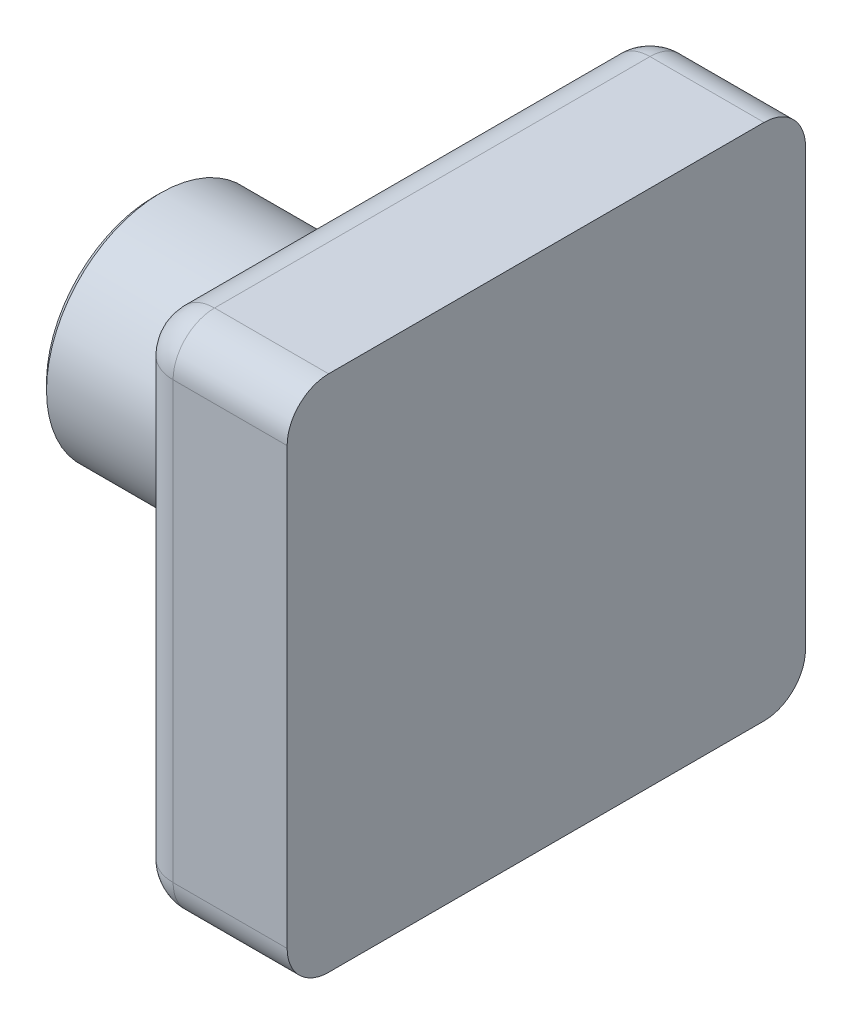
ISO-10303-21;
HEADER;
FILE_DESCRIPTION(('STEP AP214'),'2;1');
FILE_NAME('part.step','',(''),(''),'','','');
FILE_SCHEMA(('AUTOMOTIVE_DESIGN { 1 0 10303 214 1 1 1 1 }'));
ENDSEC;
DATA;
#1=APPLICATION_CONTEXT('core data for automotive mechanical design processes');
#2=APPLICATION_PROTOCOL_DEFINITION('international standard','automotive_design',2000,#1);
#3=PRODUCT_CONTEXT('',#1,'mechanical');
#4=PRODUCT('Part','Part','',(#3));
#5=PRODUCT_RELATED_PRODUCT_CATEGORY('part','',(#4));
#6=PRODUCT_DEFINITION_FORMATION('','',#4);
#7=PRODUCT_DEFINITION_CONTEXT('part definition',#1,'design');
#8=PRODUCT_DEFINITION('design','',#6,#7);
#9=PRODUCT_DEFINITION_SHAPE('','',#8);
#10=(LENGTH_UNIT() NAMED_UNIT(*) SI_UNIT(.MILLI.,.METRE.));
#11=(NAMED_UNIT(*) PLANE_ANGLE_UNIT() SI_UNIT($,.RADIAN.));
#12=(NAMED_UNIT(*) SI_UNIT($,.STERADIAN.) SOLID_ANGLE_UNIT());
#13=UNCERTAINTY_MEASURE_WITH_UNIT(LENGTH_MEASURE(1.E-05),#10,'distance_accuracy_value','');
#14=(GEOMETRIC_REPRESENTATION_CONTEXT(3) GLOBAL_UNCERTAINTY_ASSIGNED_CONTEXT((#13)) GLOBAL_UNIT_ASSIGNED_CONTEXT((#10,
#11,#12)) REPRESENTATION_CONTEXT('',''));
#15=CARTESIAN_POINT('',(0.,0.,0.));
#16=DIRECTION('',(0.,0.,1.));
#17=DIRECTION('',(1.,0.,0.));
#18=AXIS2_PLACEMENT_3D('',#15,#16,#17);
#19=CARTESIAN_POINT('',(-31.75,0.,0.));
#20=DIRECTION('',(1.,0.,0.));
#21=DIRECTION('',(0.,1.,0.));
#22=AXIS2_PLACEMENT_3D('',#19,#20,#21);
#23=PLANE('',#22);
#24=CARTESIAN_POINT('',(-31.75,0.,0.));
#25=DIRECTION('',(1.,0.,0.));
#26=DIRECTION('',(0.,1.,0.));
#27=AXIS2_PLACEMENT_3D('',#24,#25,#26);
#28=CIRCLE('',#27,10.3505);
#29=CARTESIAN_POINT('',(-31.75,10.3505,0.));
#30=VERTEX_POINT('',#29);
#31=EDGE_CURVE('E452',#30,#30,#28,.F.);
#32=ORIENTED_EDGE('',*,*,#31,.T.);
#33=EDGE_LOOP('',(#32));
#34=FACE_BOUND('',#33,.T.);
#35=CARTESIAN_POINT('',(-31.75,0.,0.));
#36=DIRECTION('',(-1.,0.,0.));
#37=DIRECTION('',(0.,0.,1.));
#38=AXIS2_PLACEMENT_3D('',#35,#36,#37);
#39=CIRCLE('',#38,8.98025612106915);
#40=CARTESIAN_POINT('',(-31.75,6.35,6.35));
#41=VERTEX_POINT('',#40);
#42=CARTESIAN_POINT('',(-31.75,6.35,-6.34999999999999));
#43=VERTEX_POINT('',#42);
#44=EDGE_CURVE('E185',#41,#43,#39,.T.);
#45=ORIENTED_EDGE('',*,*,#44,.F.);
#46=CARTESIAN_POINT('',(-31.75,-6.35,6.35000000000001));
#47=VERTEX_POINT('',#46);
#48=EDGE_CURVE('E189',#47,#41,#39,.T.);
#49=ORIENTED_EDGE('',*,*,#48,.F.);
#50=CARTESIAN_POINT('',(-31.75,-6.35,-6.35000000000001));
#51=VERTEX_POINT('',#50);
#52=EDGE_CURVE('E182',#51,#47,#39,.T.);
#53=ORIENTED_EDGE('',*,*,#52,.F.);
#54=EDGE_CURVE('E178',#43,#51,#39,.T.);
#55=ORIENTED_EDGE('',*,*,#54,.F.);
#56=EDGE_LOOP('',(#45,#49,#53,#55));
#57=FACE_BOUND('',#56,.T.);
#58=ADVANCED_FACE('F42',(#34,#57),#23,.F.);
#59=CARTESIAN_POINT('',(-31.75,0.,0.));
#60=DIRECTION('',(-1.,0.,0.));
#61=DIRECTION('',(0.,-1.,0.));
#62=AXIS2_PLACEMENT_3D('',#59,#60,#61);
#63=CYLINDRICAL_SURFACE('',#62,10.9855);
#64=CARTESIAN_POINT('',(-12.89,0.,0.));
#65=DIRECTION('',(-1.,0.,0.));
#66=DIRECTION('',(0.,-1.,0.));
#67=AXIS2_PLACEMENT_3D('',#64,#65,#66);
#68=CIRCLE('',#67,10.9855);
#69=CARTESIAN_POINT('',(-12.89,-10.9855,0.));
#70=VERTEX_POINT('',#69);
#71=EDGE_CURVE('E458',#70,#70,#68,.T.);
#72=ORIENTED_EDGE('',*,*,#71,.T.);
#73=EDGE_LOOP('',(#72));
#74=FACE_BOUND('',#73,.T.);
#75=CARTESIAN_POINT('',(-31.115,0.,0.));
#76=DIRECTION('',(1.,0.,0.));
#77=DIRECTION('',(0.,1.,0.));
#78=AXIS2_PLACEMENT_3D('',#75,#76,#77);
#79=CIRCLE('',#78,10.9855);
#80=CARTESIAN_POINT('',(-31.115,10.9855,0.));
#81=VERTEX_POINT('',#80);
#82=EDGE_CURVE('E454',#81,#81,#79,.T.);
#83=ORIENTED_EDGE('',*,*,#82,.T.);
#84=EDGE_LOOP('',(#83));
#85=FACE_BOUND('',#84,.T.);
#86=ADVANCED_FACE('F221',(#74,#85),#63,.T.);
#87=CARTESIAN_POINT('',(-31.75,0.,0.));
#88=DIRECTION('',(-1.,0.,0.));
#89=DIRECTION('',(0.,0.,1.));
#90=AXIS2_PLACEMENT_3D('',#87,#88,#89);
#91=CONICAL_SURFACE('',#90,8.98025612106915,1.0471975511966);
#92=ORIENTED_EDGE('',*,*,#54,.T.);
#93=ORIENTED_EDGE('',*,*,#52,.T.);
#94=ORIENTED_EDGE('',*,*,#48,.T.);
#95=ORIENTED_EDGE('',*,*,#44,.T.);
#96=EDGE_LOOP('',(#92,#93,#94,#95));
#97=FACE_BOUND('',#96,.T.);
#98=CARTESIAN_POINT('',(-31.4975796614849,-6.35,-5.715));
#99=CARTESIAN_POINT('',(-31.4930347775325,-6.24416666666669,-5.82083333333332));
#100=CARTESIAN_POINT('',(-31.490762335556,-6.13833333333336,-5.92666666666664));
#101=CARTESIAN_POINT('',(-31.4907623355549,-5.92666666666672,-6.13833333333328));
#102=CARTESIAN_POINT('',(-31.4930347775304,-5.8208333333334,-6.24416666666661));
#103=CARTESIAN_POINT('',(-31.4975796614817,-5.71500000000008,-6.34999999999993));
#104=B_SPLINE_CURVE_WITH_KNOTS('',3,(#98,#99,#100,#101,#102,#103),.UNSPECIFIED.,.F.,.F.,(4,2,4),
(0.,0.449064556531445,0.898129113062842),.UNSPECIFIED.);
#105=CARTESIAN_POINT('',(-31.4975796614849,-6.35,-5.71500000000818));
#106=VERTEX_POINT('',#105);
#107=CARTESIAN_POINT('',(-31.4975796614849,-5.71500000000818,-6.35));
#108=VERTEX_POINT('',#107);
#109=EDGE_CURVE('E271',#106,#108,#104,.T.);
#110=ORIENTED_EDGE('',*,*,#109,.T.);
#111=CARTESIAN_POINT('',(-34.5170187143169,-12.2216829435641,-6.35));
#112=CARTESIAN_POINT('',(-34.3615732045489,-11.9182206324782,-6.35));
#113=CARTESIAN_POINT('',(-34.2070611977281,-11.6142750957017,-6.35));
#114=CARTESIAN_POINT('',(-33.9004047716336,-11.0051661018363,-6.35));
#115=CARTESIAN_POINT('',(-33.7482605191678,-10.700002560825,-6.35));
#116=CARTESIAN_POINT('',(-33.4464743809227,-10.0874615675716,-6.35));
#117=CARTESIAN_POINT('',(-33.2968399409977,-9.78008043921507,-6.35));
#118=CARTESIAN_POINT('',(-33.0011956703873,-9.16358609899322,-6.35));
#119=CARTESIAN_POINT('',(-32.8551857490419,-8.8544729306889,-6.35));
#120=CARTESIAN_POINT('',(-32.5599848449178,-8.21743331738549,-6.35));
#121=CARTESIAN_POINT('',(-32.4110456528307,-7.88938979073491,-6.35));
#122=CARTESIAN_POINT('',(-32.1197000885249,-7.23037405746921,-6.35));
#123=CARTESIAN_POINT('',(-31.9772941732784,-6.899401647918,-6.35));
#124=CARTESIAN_POINT('',(-31.7012019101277,-6.23418432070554,-6.35));
#125=CARTESIAN_POINT('',(-31.5675074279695,-5.89994280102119,-6.35));
#126=CARTESIAN_POINT('',(-31.3115264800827,-5.22714688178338,-6.35));
#127=CARTESIAN_POINT('',(-31.1892380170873,-4.88859324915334,-6.35));
#128=CARTESIAN_POINT('',(-30.9611061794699,-4.20993043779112,-6.35));
#129=CARTESIAN_POINT('',(-30.8551015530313,-3.86987621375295,-6.35));
#130=CARTESIAN_POINT('',(-30.6628644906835,-3.18413618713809,-6.35));
#131=CARTESIAN_POINT('',(-30.5766318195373,-2.8384504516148,-6.35));
#132=CARTESIAN_POINT('',(-30.4311430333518,-2.14800522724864,-6.35));
#133=CARTESIAN_POINT('',(-30.3714127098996,-1.80334925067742,-6.35));
#134=CARTESIAN_POINT('',(-30.3042871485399,-1.28351315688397,-6.35));
#135=CARTESIAN_POINT('',(-30.2856566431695,-1.10975186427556,-6.35));
#136=CARTESIAN_POINT('',(-30.2563555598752,-0.761566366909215,-6.35));
#137=CARTESIAN_POINT('',(-30.2456841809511,-0.587142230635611,-6.35));
#138=CARTESIAN_POINT('',(-30.2314197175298,-0.205994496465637,-6.35));
#139=CARTESIAN_POINT('',(-30.2294811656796,0.000793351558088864,-6.35));
#140=CARTESIAN_POINT('',(-30.2372733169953,0.414151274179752,-6.35));
#141=CARTESIAN_POINT('',(-30.2470044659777,0.620721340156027,-6.35));
#142=CARTESIAN_POINT('',(-30.2777433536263,1.03306047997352,-6.35));
#143=CARTESIAN_POINT('',(-30.298753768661,1.23882935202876,-6.35));
#144=CARTESIAN_POINT('',(-30.3512617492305,1.64901372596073,-6.35));
#145=CARTESIAN_POINT('',(-30.3827595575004,1.85342919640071,-6.35));
#146=CARTESIAN_POINT('',(-30.4561496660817,2.26592140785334,-6.35));
#147=CARTESIAN_POINT('',(-30.4982936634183,2.473952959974,-6.35));
#148=CARTESIAN_POINT('',(-30.5912838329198,2.88804833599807,-6.35));
#149=CARTESIAN_POINT('',(-30.642130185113,3.09411211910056,-6.35));
#150=CARTESIAN_POINT('',(-30.7513127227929,3.50429697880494,-6.35));
#151=CARTESIAN_POINT('',(-30.8096511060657,3.70841746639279,-6.35));
#152=CARTESIAN_POINT('',(-30.9326808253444,4.11470771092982,-6.35));
#153=CARTESIAN_POINT('',(-30.9973717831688,4.31687758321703,-6.35));
#154=CARTESIAN_POINT('',(-31.1961967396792,4.91094204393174,-6.35));
#155=CARTESIAN_POINT('',(-31.3378374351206,5.30032383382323,-6.35));
#156=CARTESIAN_POINT('',(-31.635662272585,6.07351976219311,-6.35));
#157=CARTESIAN_POINT('',(-31.7918507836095,6.4573321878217,-6.35));
#158=CARTESIAN_POINT('',(-32.1148992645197,7.22086654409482,-6.35));
#159=CARTESIAN_POINT('',(-32.2817697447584,7.60058400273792,-6.35));
#160=CARTESIAN_POINT('',(-32.623232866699,8.35645832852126,-6.35));
#161=CARTESIAN_POINT('',(-32.7978246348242,8.73261559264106,-6.35));
#162=CARTESIAN_POINT('',(-33.1534440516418,9.48349912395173,-6.35));
#163=CARTESIAN_POINT('',(-33.3344923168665,9.85821559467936,-6.35));
#164=CARTESIAN_POINT('',(-33.7010603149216,10.605459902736,-6.35));
#165=CARTESIAN_POINT('',(-33.8865801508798,10.9779876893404,-6.35));
#166=CARTESIAN_POINT('',(-34.2609884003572,11.7210791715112,-6.35));
#167=CARTESIAN_POINT('',(-34.4498748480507,12.0916438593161,-6.35));
#168=CARTESIAN_POINT('',(-34.8303948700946,12.8313540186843,-6.35));
#169=CARTESIAN_POINT('',(-35.0220284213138,13.2004995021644,-6.35));
#170=CARTESIAN_POINT('',(-35.5484391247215,14.2071897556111,-6.35));
#171=CARTESIAN_POINT('',(-35.8854076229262,14.8435881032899,-6.35));
#172=CARTESIAN_POINT('',(-36.5640154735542,16.1140140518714,-6.35));
#173=CARTESIAN_POINT('',(-36.9056555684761,16.748041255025,-6.35));
#174=CARTESIAN_POINT('',(-37.5898982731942,18.0097984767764,-6.35));
#175=CARTESIAN_POINT('',(-37.932477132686,18.6375413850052,-6.35));
#176=CARTESIAN_POINT('',(-38.448197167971,19.5780641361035,-6.35));
#177=CARTESIAN_POINT('',(-38.6203966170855,19.8913611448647,-6.35));
#178=CARTESIAN_POINT('',(-38.9653493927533,20.5176494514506,-6.35));
#179=CARTESIAN_POINT('',(-39.138102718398,20.8306407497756,-6.35));
#180=CARTESIAN_POINT('',(-39.3110964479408,21.1434991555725,-6.35));
#181=B_SPLINE_CURVE_WITH_KNOTS('',3,(#111,#112,#113,#114,#115,#116,#117,#118,#119,#120,#121,
#122,#123,#124,#125,#126,#127,#128,#129,#130,#131,#132,#133,#134,#135,#136,#137,#138,#139,#140,
#141,#142,#143,#144,#145,#146,#147,#148,#149,#150,#151,#152,#153,#154,#155,#156,#157,#158,#159,
#160,#161,#162,#163,#164,#165,#166,#167,#168,#169,#170,#171,#172,#173,#174,#175,#176,#177,#178,
#179,#180),.UNSPECIFIED.,.F.,.F.,(4,2,2,2,2,2,2,2,2,2,2,2,2,2,2,2,2,2,2,2,2,2,2,2,2,2,2,2,2,2,2,
2,2,2,4),(0.,1.02288050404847,2.04583274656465,3.07141705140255,4.09697567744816,
5.17773511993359,6.25857004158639,7.3383808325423,8.41800218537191,9.48612698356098,
10.5542390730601,11.6023818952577,12.1264966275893,12.6505586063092,13.270611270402,
13.8906876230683,14.5109111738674,15.1311490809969,15.7677069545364,16.4042779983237,
17.0410362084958,17.6777565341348,18.9203192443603,20.1632563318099,21.4074357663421,
22.6514747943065,23.8999228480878,25.1483997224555,26.3961700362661,27.6439298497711,
29.8042128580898,31.9648433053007,34.1102472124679,35.1827527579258,36.2552565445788),.UNSPECIFIED.);
#182=CARTESIAN_POINT('',(-31.4975796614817,5.71499999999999,-6.35));
#183=VERTEX_POINT('',#182);
#184=EDGE_CURVE('E239',#183,#108,#181,.F.);
#185=ORIENTED_EDGE('',*,*,#184,.F.);
#186=CARTESIAN_POINT('',(-31.4975796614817,5.715,-6.35));
#187=CARTESIAN_POINT('',(-31.4930347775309,5.82083333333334,-6.24416666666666));
#188=CARTESIAN_POINT('',(-31.4907623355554,5.92666666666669,-6.13833333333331));
#189=CARTESIAN_POINT('',(-31.4907623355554,6.13833333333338,-5.92666666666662));
#190=CARTESIAN_POINT('',(-31.4930347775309,6.24416666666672,-5.82083333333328));
#191=CARTESIAN_POINT('',(-31.4975796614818,6.35000000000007,-5.71499999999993));
#192=B_SPLINE_CURVE_WITH_KNOTS('',3,(#186,#187,#188,#189,#190,#191),.UNSPECIFIED.,.F.,.F.,(4,2,
4),(0.,0.449064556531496,0.898129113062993),.UNSPECIFIED.);
#193=CARTESIAN_POINT('',(-31.4975796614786,6.35,-5.71499999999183));
#194=VERTEX_POINT('',#193);
#195=EDGE_CURVE('E263',#183,#194,#192,.T.);
#196=ORIENTED_EDGE('',*,*,#195,.T.);
#197=CARTESIAN_POINT('',(-34.5170187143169,6.35,-12.2216829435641));
#198=CARTESIAN_POINT('',(-34.3615732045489,6.35,-11.9182206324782));
#199=CARTESIAN_POINT('',(-34.2070611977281,6.35,-11.6142750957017));
#200=CARTESIAN_POINT('',(-33.9004047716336,6.35,-11.0051661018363));
#201=CARTESIAN_POINT('',(-33.7482605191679,6.35,-10.700002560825));
#202=CARTESIAN_POINT('',(-33.4464743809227,6.35,-10.0874615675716));
#203=CARTESIAN_POINT('',(-33.2968399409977,6.35,-9.78008043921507));
#204=CARTESIAN_POINT('',(-33.0011956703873,6.35,-9.16358609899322));
#205=CARTESIAN_POINT('',(-32.8551857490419,6.35,-8.85447293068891));
#206=CARTESIAN_POINT('',(-32.5599848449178,6.35,-8.2174333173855));
#207=CARTESIAN_POINT('',(-32.4110456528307,6.35,-7.88938979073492));
#208=CARTESIAN_POINT('',(-32.1197000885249,6.35,-7.23037405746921));
#209=CARTESIAN_POINT('',(-31.9772941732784,6.35,-6.899401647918));
#210=CARTESIAN_POINT('',(-31.7012019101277,6.35,-6.23418432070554));
#211=CARTESIAN_POINT('',(-31.5675074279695,6.35,-5.89994280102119));
#212=CARTESIAN_POINT('',(-31.3115264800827,6.35,-5.22714688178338));
#213=CARTESIAN_POINT('',(-31.1892380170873,6.35,-4.88859324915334));
#214=CARTESIAN_POINT('',(-30.9611061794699,6.35,-4.20993043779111));
#215=CARTESIAN_POINT('',(-30.8551015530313,6.35,-3.86987621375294));
#216=CARTESIAN_POINT('',(-30.6628644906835,6.35,-3.18413618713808));
#217=CARTESIAN_POINT('',(-30.5766318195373,6.35,-2.8384504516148));
#218=CARTESIAN_POINT('',(-30.4311430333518,6.35,-2.14800522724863));
#219=CARTESIAN_POINT('',(-30.3714127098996,6.35,-1.80334925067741));
#220=CARTESIAN_POINT('',(-30.3042871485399,6.35,-1.28351315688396));
#221=CARTESIAN_POINT('',(-30.2856566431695,6.35,-1.10975186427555));
#222=CARTESIAN_POINT('',(-30.2563555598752,6.35,-0.76156636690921));
#223=CARTESIAN_POINT('',(-30.2456841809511,6.35,-0.587142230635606));
#224=CARTESIAN_POINT('',(-30.2314197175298,6.35,-0.205994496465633));
#225=CARTESIAN_POINT('',(-30.2294811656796,6.35,0.000793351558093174));
#226=CARTESIAN_POINT('',(-30.2372733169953,6.35,0.414151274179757));
#227=CARTESIAN_POINT('',(-30.2470044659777,6.35,0.620721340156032));
#228=CARTESIAN_POINT('',(-30.2777433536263,6.35,1.03306047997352));
#229=CARTESIAN_POINT('',(-30.298753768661,6.35,1.23882935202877));
#230=CARTESIAN_POINT('',(-30.3512617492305,6.35,1.64901372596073));
#231=CARTESIAN_POINT('',(-30.3827595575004,6.35,1.85342919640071));
#232=CARTESIAN_POINT('',(-30.4561496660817,6.35,2.26592140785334));
#233=CARTESIAN_POINT('',(-30.4982936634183,6.35,2.473952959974));
#234=CARTESIAN_POINT('',(-30.5912838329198,6.35,2.88804833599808));
#235=CARTESIAN_POINT('',(-30.642130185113,6.35,3.09411211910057));
#236=CARTESIAN_POINT('',(-30.751312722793,6.35,3.50429697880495));
#237=CARTESIAN_POINT('',(-30.8096511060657,6.35,3.70841746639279));
#238=CARTESIAN_POINT('',(-30.9326808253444,6.35,4.11470771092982));
#239=CARTESIAN_POINT('',(-30.9973717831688,6.35,4.31687758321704));
#240=CARTESIAN_POINT('',(-31.1961967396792,6.35,4.91094204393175));
#241=CARTESIAN_POINT('',(-31.3378374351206,6.35,5.30032383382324));
#242=CARTESIAN_POINT('',(-31.635662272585,6.35,6.07351976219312));
#243=CARTESIAN_POINT('',(-31.7918507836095,6.35,6.45733218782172));
#244=CARTESIAN_POINT('',(-32.1148992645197,6.35,7.22086654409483));
#245=CARTESIAN_POINT('',(-32.2817697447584,6.35,7.60058400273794));
#246=CARTESIAN_POINT('',(-32.623232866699,6.35,8.35645832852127));
#247=CARTESIAN_POINT('',(-32.7978246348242,6.35,8.73261559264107));
#248=CARTESIAN_POINT('',(-33.1534440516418,6.35,9.48349912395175));
#249=CARTESIAN_POINT('',(-33.3344923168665,6.35,9.85821559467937));
#250=CARTESIAN_POINT('',(-33.7010603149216,6.35,10.605459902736));
#251=CARTESIAN_POINT('',(-33.8865801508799,6.35,10.9779876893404));
#252=CARTESIAN_POINT('',(-34.2609884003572,6.35,11.7210791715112));
#253=CARTESIAN_POINT('',(-34.4498748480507,6.35,12.0916438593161));
#254=CARTESIAN_POINT('',(-34.8303948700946,6.35,12.8313540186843));
#255=CARTESIAN_POINT('',(-35.0220284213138,6.35,13.2004995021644));
#256=CARTESIAN_POINT('',(-35.5484391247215,6.35,14.2071897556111));
#257=CARTESIAN_POINT('',(-35.8854076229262,6.35,14.8435881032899));
#258=CARTESIAN_POINT('',(-36.5640154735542,6.35,16.1140140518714));
#259=CARTESIAN_POINT('',(-36.9056555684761,6.35,16.748041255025));
#260=CARTESIAN_POINT('',(-37.5898982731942,6.35,18.0097984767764));
#261=CARTESIAN_POINT('',(-37.932477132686,6.35,18.6375413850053));
#262=CARTESIAN_POINT('',(-38.448197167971,6.35,19.5780641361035));
#263=CARTESIAN_POINT('',(-38.6203966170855,6.35,19.8913611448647));
#264=CARTESIAN_POINT('',(-38.9653493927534,6.35,20.5176494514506));
#265=CARTESIAN_POINT('',(-39.138102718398,6.35,20.8306407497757));
#266=CARTESIAN_POINT('',(-39.3110964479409,6.35,21.1434991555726));
#267=B_SPLINE_CURVE_WITH_KNOTS('',3,(#197,#198,#199,#200,#201,#202,#203,#204,#205,#206,#207,
#208,#209,#210,#211,#212,#213,#214,#215,#216,#217,#218,#219,#220,#221,#222,#223,#224,#225,#226,
#227,#228,#229,#230,#231,#232,#233,#234,#235,#236,#237,#238,#239,#240,#241,#242,#243,#244,#245,
#246,#247,#248,#249,#250,#251,#252,#253,#254,#255,#256,#257,#258,#259,#260,#261,#262,#263,#264,
#265,#266),.UNSPECIFIED.,.F.,.F.,(4,2,2,2,2,2,2,2,2,2,2,2,2,2,2,2,2,2,2,2,2,2,2,2,2,2,2,2,2,2,2,
2,2,2,4),(0.,1.02288050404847,2.04583274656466,3.07141705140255,4.09697567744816,
5.17773511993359,6.2585700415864,7.33838083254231,8.41800218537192,9.48612698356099,
10.5542390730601,11.6023818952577,12.1264966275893,12.6505586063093,13.270611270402,
13.8906876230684,14.5109111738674,15.1311490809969,15.7677069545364,16.4042779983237,
17.0410362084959,17.6777565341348,18.9203192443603,20.1632563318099,21.4074357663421,
22.6514747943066,23.8999228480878,25.1483997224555,26.3961700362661,27.6439298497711,
29.8042128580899,31.9648433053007,34.110247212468,35.1827527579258,36.2552565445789),.UNSPECIFIED.);
#268=CARTESIAN_POINT('',(-31.4975796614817,6.35,5.715));
#269=VERTEX_POINT('',#268);
#270=EDGE_CURVE('E206',#269,#194,#267,.F.);
#271=ORIENTED_EDGE('',*,*,#270,.F.);
#272=CARTESIAN_POINT('',(-31.4975796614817,6.35,5.715));
#273=CARTESIAN_POINT('',(-31.4930347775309,6.24416666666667,5.82083333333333));
#274=CARTESIAN_POINT('',(-31.4907623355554,6.13833333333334,5.92666666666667));
#275=CARTESIAN_POINT('',(-31.4907623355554,5.92666666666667,6.13833333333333));
#276=CARTESIAN_POINT('',(-31.4930347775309,5.82083333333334,6.24416666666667));
#277=CARTESIAN_POINT('',(-31.4975796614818,5.71500000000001,6.35));
#278=B_SPLINE_CURVE_WITH_KNOTS('',3,(#272,#273,#274,#275,#276,#277),.UNSPECIFIED.,.F.,.F.,(4,2,
4),(0.,0.449064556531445,0.89812911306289),.UNSPECIFIED.);
#279=CARTESIAN_POINT('',(-31.4975796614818,5.71500000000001,6.35));
#280=VERTEX_POINT('',#279);
#281=EDGE_CURVE('E256',#269,#280,#278,.T.);
#282=ORIENTED_EDGE('',*,*,#281,.T.);
#283=CARTESIAN_POINT('',(-34.5170187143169,-12.2216829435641,6.35));
#284=CARTESIAN_POINT('',(-34.3615732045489,-11.9182206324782,6.35));
#285=CARTESIAN_POINT('',(-34.2070611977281,-11.6142750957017,6.35));
#286=CARTESIAN_POINT('',(-33.9004047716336,-11.0051661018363,6.35));
#287=CARTESIAN_POINT('',(-33.7482605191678,-10.700002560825,6.35));
#288=CARTESIAN_POINT('',(-33.4464743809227,-10.0874615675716,6.35));
#289=CARTESIAN_POINT('',(-33.2968399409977,-9.78008043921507,6.35));
#290=CARTESIAN_POINT('',(-33.0011956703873,-9.16358609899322,6.35));
#291=CARTESIAN_POINT('',(-32.8551857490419,-8.85447293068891,6.35));
#292=CARTESIAN_POINT('',(-32.5599848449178,-8.2174333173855,6.35));
#293=CARTESIAN_POINT('',(-32.4110456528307,-7.88938979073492,6.35));
#294=CARTESIAN_POINT('',(-32.1197000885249,-7.23037405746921,6.35));
#295=CARTESIAN_POINT('',(-31.9772941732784,-6.899401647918,6.35));
#296=CARTESIAN_POINT('',(-31.7012019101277,-6.23418432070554,6.35));
#297=CARTESIAN_POINT('',(-31.5675074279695,-5.89994280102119,6.35));
#298=CARTESIAN_POINT('',(-31.3115264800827,-5.22714688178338,6.35));
#299=CARTESIAN_POINT('',(-31.1892380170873,-4.88859324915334,6.35));
#300=CARTESIAN_POINT('',(-30.9611061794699,-4.20993043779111,6.35));
#301=CARTESIAN_POINT('',(-30.8551015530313,-3.86987621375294,6.35));
#302=CARTESIAN_POINT('',(-30.6628644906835,-3.18413618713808,6.35));
#303=CARTESIAN_POINT('',(-30.5766318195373,-2.8384504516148,6.35));
#304=CARTESIAN_POINT('',(-30.4311430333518,-2.14800522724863,6.35));
#305=CARTESIAN_POINT('',(-30.3714127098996,-1.80334925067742,6.35));
#306=CARTESIAN_POINT('',(-30.3042871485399,-1.28351315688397,6.35));
#307=CARTESIAN_POINT('',(-30.2856566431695,-1.10975186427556,6.35));
#308=CARTESIAN_POINT('',(-30.2563555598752,-0.761566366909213,6.35));
#309=CARTESIAN_POINT('',(-30.2456841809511,-0.58714223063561,6.35));
#310=CARTESIAN_POINT('',(-30.2314197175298,-0.205994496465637,6.35));
#311=CARTESIAN_POINT('',(-30.2294811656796,0.00079335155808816,6.35));
#312=CARTESIAN_POINT('',(-30.2372733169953,0.414151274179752,6.35));
#313=CARTESIAN_POINT('',(-30.2470044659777,0.620721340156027,6.35));
#314=CARTESIAN_POINT('',(-30.2777433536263,1.03306047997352,6.35));
#315=CARTESIAN_POINT('',(-30.298753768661,1.23882935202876,6.35));
#316=CARTESIAN_POINT('',(-30.3512617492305,1.64901372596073,6.35));
#317=CARTESIAN_POINT('',(-30.3827595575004,1.85342919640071,6.35));
#318=CARTESIAN_POINT('',(-30.4561496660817,2.26592140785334,6.35));
#319=CARTESIAN_POINT('',(-30.4982936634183,2.473952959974,6.35));
#320=CARTESIAN_POINT('',(-30.5912838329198,2.88804833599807,6.35));
#321=CARTESIAN_POINT('',(-30.642130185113,3.09411211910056,6.35));
#322=CARTESIAN_POINT('',(-30.7513127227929,3.50429697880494,6.35));
#323=CARTESIAN_POINT('',(-30.8096511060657,3.70841746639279,6.35));
#324=CARTESIAN_POINT('',(-30.9326808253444,4.11470771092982,6.35));
#325=CARTESIAN_POINT('',(-30.9973717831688,4.31687758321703,6.35));
#326=CARTESIAN_POINT('',(-31.1961967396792,4.91094204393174,6.35));
#327=CARTESIAN_POINT('',(-31.3378374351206,5.30032383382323,6.35));
#328=CARTESIAN_POINT('',(-31.635662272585,6.07351976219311,6.35));
#329=CARTESIAN_POINT('',(-31.7918507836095,6.45733218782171,6.35));
#330=CARTESIAN_POINT('',(-32.1148992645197,7.22086654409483,6.35));
#331=CARTESIAN_POINT('',(-32.2817697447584,7.60058400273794,6.35));
#332=CARTESIAN_POINT('',(-32.623232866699,8.35645832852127,6.35));
#333=CARTESIAN_POINT('',(-32.7978246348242,8.73261559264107,6.35));
#334=CARTESIAN_POINT('',(-33.1534440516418,9.48349912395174,6.35));
#335=CARTESIAN_POINT('',(-33.3344923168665,9.85821559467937,6.35));
#336=CARTESIAN_POINT('',(-33.7010603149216,10.605459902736,6.35));
#337=CARTESIAN_POINT('',(-33.8865801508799,10.9779876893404,6.35));
#338=CARTESIAN_POINT('',(-34.2609884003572,11.7210791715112,6.35));
#339=CARTESIAN_POINT('',(-34.4498748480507,12.0916438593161,6.35));
#340=CARTESIAN_POINT('',(-34.8303948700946,12.8313540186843,6.35));
#341=CARTESIAN_POINT('',(-35.0220284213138,13.2004995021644,6.35));
#342=CARTESIAN_POINT('',(-35.5484391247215,14.2071897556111,6.35));
#343=CARTESIAN_POINT('',(-35.8854076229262,14.8435881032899,6.35));
#344=CARTESIAN_POINT('',(-36.5640154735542,16.1140140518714,6.35));
#345=CARTESIAN_POINT('',(-36.9056555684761,16.748041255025,6.35));
#346=CARTESIAN_POINT('',(-37.5898982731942,18.0097984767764,6.35));
#347=CARTESIAN_POINT('',(-37.932477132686,18.6375413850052,6.35));
#348=CARTESIAN_POINT('',(-38.448197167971,19.5780641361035,6.35));
#349=CARTESIAN_POINT('',(-38.6203966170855,19.8913611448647,6.35));
#350=CARTESIAN_POINT('',(-38.9653493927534,20.5176494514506,6.35));
#351=CARTESIAN_POINT('',(-39.138102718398,20.8306407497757,6.35));
#352=CARTESIAN_POINT('',(-39.3110964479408,21.1434991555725,6.35));
#353=B_SPLINE_CURVE_WITH_KNOTS('',3,(#283,#284,#285,#286,#287,#288,#289,#290,#291,#292,#293,
#294,#295,#296,#297,#298,#299,#300,#301,#302,#303,#304,#305,#306,#307,#308,#309,#310,#311,#312,
#313,#314,#315,#316,#317,#318,#319,#320,#321,#322,#323,#324,#325,#326,#327,#328,#329,#330,#331,
#332,#333,#334,#335,#336,#337,#338,#339,#340,#341,#342,#343,#344,#345,#346,#347,#348,#349,#350,
#351,#352),.UNSPECIFIED.,.F.,.F.,(4,2,2,2,2,2,2,2,2,2,2,2,2,2,2,2,2,2,2,2,2,2,2,2,2,2,2,2,2,2,2,
2,2,2,4),(0.,1.02288050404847,2.04583274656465,3.07141705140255,4.09697567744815,
5.17773511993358,6.25857004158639,7.3383808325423,8.41800218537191,9.48612698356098,
10.5542390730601,11.6023818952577,12.1264966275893,12.6505586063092,13.270611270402,
13.8906876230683,14.5109111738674,15.1311490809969,15.7677069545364,16.4042779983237,
17.0410362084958,17.6777565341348,18.9203192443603,20.1632563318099,21.4074357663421,
22.6514747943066,23.8999228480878,25.1483997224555,26.3961700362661,27.6439298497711,
29.8042128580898,31.9648433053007,34.1102472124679,35.1827527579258,36.2552565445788),.UNSPECIFIED.);
#354=CARTESIAN_POINT('',(-31.4975796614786,-5.71499999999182,6.35));
#355=VERTEX_POINT('',#354);
#356=EDGE_CURVE('E196',#355,#280,#353,.T.);
#357=ORIENTED_EDGE('',*,*,#356,.F.);
#358=CARTESIAN_POINT('',(-31.4975796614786,-5.715,6.35));
#359=CARTESIAN_POINT('',(-31.4930347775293,-5.82083333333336,6.24416666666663));
#360=CARTESIAN_POINT('',(-31.4907623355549,-5.92666666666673,6.13833333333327));
#361=CARTESIAN_POINT('',(-31.490762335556,-6.13833333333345,5.92666666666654));
#362=CARTESIAN_POINT('',(-31.4930347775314,-6.24416666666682,5.82083333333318));
#363=CARTESIAN_POINT('',(-31.4975796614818,-6.35000000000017,5.71499999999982));
#364=B_SPLINE_CURVE_WITH_KNOTS('',3,(#358,#359,#360,#361,#362,#363),.UNSPECIFIED.,.F.,.F.,(4,2,
4),(0.,0.449064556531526,0.898129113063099),.UNSPECIFIED.);
#365=CARTESIAN_POINT('',(-31.4975796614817,-6.35,5.715));
#366=VERTEX_POINT('',#365);
#367=EDGE_CURVE('E248',#355,#366,#364,.T.);
#368=ORIENTED_EDGE('',*,*,#367,.T.);
#369=CARTESIAN_POINT('',(-34.5170187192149,-6.35,-12.2216829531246));
#370=CARTESIAN_POINT('',(-34.361573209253,-6.35,-11.9182206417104));
#371=CARTESIAN_POINT('',(-34.2070612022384,-6.35,-11.6142751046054));
#372=CARTESIAN_POINT('',(-33.9004047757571,-6.35,-11.0051661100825));
#373=CARTESIAN_POINT('',(-33.7482605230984,-6.35,-10.7000025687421));
#374=CARTESIAN_POINT('',(-33.4464743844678,-6.35,-10.087461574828));
#375=CARTESIAN_POINT('',(-33.2968399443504,-6.35,-9.78008044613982));
#376=CARTESIAN_POINT('',(-33.0011956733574,-6.35,-9.16358610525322));
#377=CARTESIAN_POINT('',(-32.8551857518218,-6.35,-8.85447293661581));
#378=CARTESIAN_POINT('',(-32.5599848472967,-6.35,-8.21743332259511));
#379=CARTESIAN_POINT('',(-32.4110456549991,-6.35,-7.88938979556));
#380=CARTESIAN_POINT('',(-32.1197000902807,-6.35,-7.23037406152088));
#381=CARTESIAN_POINT('',(-31.9772941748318,-6.35,-6.89940165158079));
#382=CARTESIAN_POINT('',(-31.7012019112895,-6.35,-6.23418432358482));
#383=CARTESIAN_POINT('',(-31.567507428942,-6.35,-5.89994280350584));
#384=CARTESIAN_POINT('',(-31.3115264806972,-6.35,-5.22714688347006));
#385=CARTESIAN_POINT('',(-31.1892380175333,-6.35,-4.88859325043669));
#386=CARTESIAN_POINT('',(-30.9611061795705,-6.35,-4.20993043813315));
#387=CARTESIAN_POINT('',(-30.8551015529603,-6.35,-3.86987621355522));
#388=CARTESIAN_POINT('',(-30.6628644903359,-6.35,-3.18413618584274));
#389=CARTESIAN_POINT('',(-30.5766318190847,-6.35,-2.8384504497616));
#390=CARTESIAN_POINT('',(-30.4311430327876,-6.35,-2.14800522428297));
#391=CARTESIAN_POINT('',(-30.3714127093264,-6.35,-1.80334924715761));
#392=CARTESIAN_POINT('',(-30.3042871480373,-6.35,-1.28351315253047));
#393=CARTESIAN_POINT('',(-30.2856566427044,-6.35,-1.1097518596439));
#394=CARTESIAN_POINT('',(-30.2563555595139,-6.35,-0.761566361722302));
#395=CARTESIAN_POINT('',(-30.245684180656,-6.35,-0.587142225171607));
#396=CARTESIAN_POINT('',(-30.2314197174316,-6.35,-0.205994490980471));
#397=CARTESIAN_POINT('',(-30.229481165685,-6.35,0.000793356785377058));
#398=CARTESIAN_POINT('',(-30.2372733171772,-6.35,0.414151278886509));
#399=CARTESIAN_POINT('',(-30.2470044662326,-6.35,0.620721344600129));
#400=CARTESIAN_POINT('',(-30.2777433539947,-6.35,1.03306048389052));
#401=CARTESIAN_POINT('',(-30.29875376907,-6.35,1.23882935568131));
#402=CARTESIAN_POINT('',(-30.3512617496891,-6.35,1.64901372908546));
#403=CARTESIAN_POINT('',(-30.3827595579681,-6.35,1.85342919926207));
#404=CARTESIAN_POINT('',(-30.4561496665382,-6.35,2.26592141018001));
#405=CARTESIAN_POINT('',(-30.4982936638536,-6.35,2.47395296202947));
#406=CARTESIAN_POINT('',(-30.591283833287,-6.35,2.88804833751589));
#407=CARTESIAN_POINT('',(-30.6421301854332,-6.35,3.09411212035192));
#408=CARTESIAN_POINT('',(-30.7513127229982,-6.35,3.50429697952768));
#409=CARTESIAN_POINT('',(-30.8096511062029,-6.35,3.70841746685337));
#410=CARTESIAN_POINT('',(-30.9326808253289,-6.35,4.11470771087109));
#411=CARTESIAN_POINT('',(-30.9973717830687,-6.35,4.31687758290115));
#412=CARTESIAN_POINT('',(-31.1961967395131,-6.35,4.91094204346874));
#413=CARTESIAN_POINT('',(-31.3378374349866,-6.35,5.30032383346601));
#414=CARTESIAN_POINT('',(-31.635662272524,-6.35,6.07351976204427));
#415=CARTESIAN_POINT('',(-31.7918507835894,-6.35,6.45733218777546));
#416=CARTESIAN_POINT('',(-32.1148992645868,-6.35,7.22086654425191));
#417=CARTESIAN_POINT('',(-32.2817697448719,-6.35,7.60058400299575));
#418=CARTESIAN_POINT('',(-32.6232328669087,-6.35,8.35645832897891));
#419=CARTESIAN_POINT('',(-32.7978246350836,-6.35,8.73261559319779));
#420=CARTESIAN_POINT('',(-33.1534440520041,-6.35,9.48349912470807));
#421=CARTESIAN_POINT('',(-33.3344923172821,-6.35,9.85821559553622));
#422=CARTESIAN_POINT('',(-33.701060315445,-6.35,10.6054599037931));
#423=CARTESIAN_POINT('',(-33.8865801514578,-6.35,10.9779876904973));
#424=CARTESIAN_POINT('',(-34.2609884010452,-6.35,11.7210791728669));
#425=CARTESIAN_POINT('',(-34.4498748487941,-6.35,12.0916438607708));
#426=CARTESIAN_POINT('',(-34.8303948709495,-6.35,12.8313540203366));
#427=CARTESIAN_POINT('',(-35.0220284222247,-6.35,13.2004995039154));
#428=CARTESIAN_POINT('',(-35.5484391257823,-6.35,14.207189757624));
#429=CARTESIAN_POINT('',(-35.8854076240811,-6.35,14.8435881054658));
#430=CARTESIAN_POINT('',(-36.5640154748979,-6.35,16.1140140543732));
#431=CARTESIAN_POINT('',(-36.9056555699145,-6.35,16.7480412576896));
#432=CARTESIAN_POINT('',(-37.5898982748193,-6.35,18.009798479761));
#433=CARTESIAN_POINT('',(-37.9324771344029,-6.35,18.637541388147));
#434=CARTESIAN_POINT('',(-38.4481971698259,-6.35,19.5780641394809));
#435=CARTESIAN_POINT('',(-38.6203966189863,-6.35,19.8913611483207));
#436=CARTESIAN_POINT('',(-38.965349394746,-6.35,20.5176494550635));
#437=CARTESIAN_POINT('',(-39.1381027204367,-6.35,20.8306407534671));
#438=CARTESIAN_POINT('',(-39.3110964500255,-6.35,21.1434991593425));
#439=B_SPLINE_CURVE_WITH_KNOTS('',3,(#369,#370,#371,#372,#373,#374,#375,#376,#377,#378,#379,
#380,#381,#382,#383,#384,#385,#386,#387,#388,#389,#390,#391,#392,#393,#394,#395,#396,#397,#398,
#399,#400,#401,#402,#403,#404,#405,#406,#407,#408,#409,#410,#411,#412,#413,#414,#415,#416,#417,
#418,#419,#420,#421,#422,#423,#424,#425,#426,#427,#428,#429,#430,#431,#432,#433,#434,#435,#436,
#437,#438),.UNSPECIFIED.,.F.,.F.,(4,2,2,2,2,2,2,2,2,2,2,2,2,2,2,2,2,2,2,2,2,2,2,2,2,2,2,2,2,2,2,
2,2,2,4),(0.,1.02288050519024,2.0458327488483,3.07141705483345,4.09697568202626,
5.17773512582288,6.25857004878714,7.33838084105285,8.41800219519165,9.48612699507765,
10.5542390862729,11.6023819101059,12.1264966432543,12.6505586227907,13.2706112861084,
13.8906876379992,14.5109111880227,15.1311490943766,15.7677069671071,16.4042780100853,
17.0410362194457,17.6777565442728,18.9203192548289,20.1632563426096,21.4074357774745,
22.6514748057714,23.8999228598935,25.1483997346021,26.3961700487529,27.643929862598,
29.8042128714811,31.9648433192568,34.1102472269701,35.1827527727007,36.2552565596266),.UNSPECIFIED.);
#440=EDGE_CURVE('E227',#106,#366,#439,.T.);
#441=ORIENTED_EDGE('',*,*,#440,.F.);
#442=EDGE_LOOP('',(#110,#185,#196,#271,#282,#357,#368,#441));
#443=FACE_BOUND('',#442,.T.);
#444=ADVANCED_FACE('F180',(#97,#443),#91,.F.);
#445=CARTESIAN_POINT('',(-16.51,0.,0.));
#446=DIRECTION('',(-1.,0.,0.));
#447=DIRECTION('',(0.,0.,1.));
#448=AXIS2_PLACEMENT_3D('',#445,#446,#447);
#449=PLANE('',#448);
#450=DIRECTION('',(0.,0.,1.));
#451=VECTOR('',#450,1.);
#452=CARTESIAN_POINT('',(-16.51,-6.35,6.35));
#453=LINE('',#452,#451);
#454=CARTESIAN_POINT('',(-16.51,-6.35,-5.715));
#455=VERTEX_POINT('',#454);
#456=CARTESIAN_POINT('',(-16.51,-6.35,5.715));
#457=VERTEX_POINT('',#456);
#458=EDGE_CURVE('E437',#455,#457,#453,.T.);
#459=ORIENTED_EDGE('',*,*,#458,.T.);
#460=DIRECTION('',(0.,-0.70710678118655,-0.707106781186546));
#461=VECTOR('',#460,1.);
#462=CARTESIAN_POINT('',(-16.51,-6.03249999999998,6.03250000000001));
#463=LINE('',#462,#461);
#464=CARTESIAN_POINT('',(-16.51,-5.715,6.35));
#465=VERTEX_POINT('',#464);
#466=EDGE_CURVE('E369',#457,#465,#463,.F.);
#467=ORIENTED_EDGE('',*,*,#466,.T.);
#468=DIRECTION('',(0.,1.,0.));
#469=VECTOR('',#468,1.);
#470=CARTESIAN_POINT('',(-16.51,-6.35,6.35));
#471=LINE('',#470,#469);
#472=CARTESIAN_POINT('',(-16.51,5.71500000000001,6.35));
#473=VERTEX_POINT('',#472);
#474=EDGE_CURVE('E442',#465,#473,#471,.T.);
#475=ORIENTED_EDGE('',*,*,#474,.T.);
#476=DIRECTION('',(0.,-0.707106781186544,0.707106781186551));
#477=VECTOR('',#476,1.);
#478=CARTESIAN_POINT('',(-16.51,6.03250000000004,6.03249999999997));
#479=LINE('',#478,#477);
#480=CARTESIAN_POINT('',(-16.51,6.35,5.715));
#481=VERTEX_POINT('',#480);
#482=EDGE_CURVE('E379',#473,#481,#479,.F.);
#483=ORIENTED_EDGE('',*,*,#482,.T.);
#484=DIRECTION('',(0.,0.,-1.));
#485=VECTOR('',#484,1.);
#486=CARTESIAN_POINT('',(-16.51,6.35,6.35));
#487=LINE('',#486,#485);
#488=CARTESIAN_POINT('',(-16.51,6.35,-5.715));
#489=VERTEX_POINT('',#488);
#490=EDGE_CURVE('E418',#481,#489,#487,.T.);
#491=ORIENTED_EDGE('',*,*,#490,.T.);
#492=DIRECTION('',(0.,0.70710678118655,0.707106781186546));
#493=VECTOR('',#492,1.);
#494=CARTESIAN_POINT('',(-16.51,6.03249999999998,-6.03250000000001));
#495=LINE('',#494,#493);
#496=CARTESIAN_POINT('',(-16.51,5.715,-6.35));
#497=VERTEX_POINT('',#496);
#498=EDGE_CURVE('E385',#489,#497,#495,.F.);
#499=ORIENTED_EDGE('',*,*,#498,.T.);
#500=DIRECTION('',(0.,-1.,0.));
#501=VECTOR('',#500,1.);
#502=CARTESIAN_POINT('',(-16.51,-6.35,-6.35));
#503=LINE('',#502,#501);
#504=CARTESIAN_POINT('',(-16.51,-5.71500000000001,-6.35));
#505=VERTEX_POINT('',#504);
#506=EDGE_CURVE('E431',#497,#505,#503,.T.);
#507=ORIENTED_EDGE('',*,*,#506,.T.);
#508=DIRECTION('',(0.,0.707106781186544,-0.707106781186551));
#509=VECTOR('',#508,1.);
#510=CARTESIAN_POINT('',(-16.51,-6.03250000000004,-6.03249999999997));
#511=LINE('',#510,#509);
#512=EDGE_CURVE('E425',#505,#455,#511,.F.);
#513=ORIENTED_EDGE('',*,*,#512,.T.);
#514=EDGE_LOOP('',(#459,#467,#475,#483,#491,#499,#507,#513));
#515=FACE_BOUND('',#514,.T.);
#516=ADVANCED_FACE('F220',(#515),#449,.T.);
#517=CARTESIAN_POINT('',(-16.51,-6.35,6.35));
#518=DIRECTION('',(0.,-1.,0.));
#519=DIRECTION('',(0.,0.,-1.));
#520=AXIS2_PLACEMENT_3D('',#517,#518,#519);
#521=PLANE('',#520);
#522=ORIENTED_EDGE('',*,*,#440,.T.);
#523=DIRECTION('',(1.,0.,0.));
#524=VECTOR('',#523,1.);
#525=CARTESIAN_POINT('',(-16.51,-6.35,5.715));
#526=LINE('',#525,#524);
#527=EDGE_CURVE('E370',#366,#457,#526,.T.);
#528=ORIENTED_EDGE('',*,*,#527,.T.);
#529=ORIENTED_EDGE('',*,*,#458,.F.);
#530=DIRECTION('',(-1.,0.,0.));
#531=VECTOR('',#530,1.);
#532=CARTESIAN_POINT('',(-31.75,-6.35,-5.715));
#533=LINE('',#532,#531);
#534=EDGE_CURVE('E416',#455,#106,#533,.T.);
#535=ORIENTED_EDGE('',*,*,#534,.T.);
#536=EDGE_LOOP('',(#522,#528,#529,#535));
#537=FACE_BOUND('',#536,.T.);
#538=ADVANCED_FACE('F450',(#537),#521,.F.);
#539=CARTESIAN_POINT('',(-16.51,-6.35,6.35));
#540=DIRECTION('',(0.,0.,1.));
#541=DIRECTION('',(1.,0.,0.));
#542=AXIS2_PLACEMENT_3D('',#539,#540,#541);
#543=PLANE('',#542);
#544=ORIENTED_EDGE('',*,*,#474,.F.);
#545=DIRECTION('',(-1.,0.,0.));
#546=VECTOR('',#545,1.);
#547=CARTESIAN_POINT('',(-31.75,-5.715,6.35));
#548=LINE('',#547,#546);
#549=EDGE_CURVE('E372',#465,#355,#548,.T.);
#550=ORIENTED_EDGE('',*,*,#549,.T.);
#551=ORIENTED_EDGE('',*,*,#356,.T.);
#552=DIRECTION('',(1.,0.,0.));
#553=VECTOR('',#552,1.);
#554=CARTESIAN_POINT('',(-16.51,5.71500000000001,6.35));
#555=LINE('',#554,#553);
#556=EDGE_CURVE('E411',#280,#473,#555,.T.);
#557=ORIENTED_EDGE('',*,*,#556,.T.);
#558=EDGE_LOOP('',(#544,#550,#551,#557));
#559=FACE_BOUND('',#558,.T.);
#560=ADVANCED_FACE('F213',(#559),#543,.F.);
#561=CARTESIAN_POINT('',(-16.51,6.35,6.35));
#562=DIRECTION('',(0.,1.,0.));
#563=DIRECTION('',(0.,0.,1.));
#564=AXIS2_PLACEMENT_3D('',#561,#562,#563);
#565=PLANE('',#564);
#566=ORIENTED_EDGE('',*,*,#490,.F.);
#567=DIRECTION('',(-1.,0.,0.));
#568=VECTOR('',#567,1.);
#569=CARTESIAN_POINT('',(-31.75,6.35,5.715));
#570=LINE('',#569,#568);
#571=EDGE_CURVE('E383',#481,#269,#570,.T.);
#572=ORIENTED_EDGE('',*,*,#571,.T.);
#573=ORIENTED_EDGE('',*,*,#270,.T.);
#574=DIRECTION('',(1.,0.,0.));
#575=VECTOR('',#574,1.);
#576=CARTESIAN_POINT('',(-16.51,6.35,-5.715));
#577=LINE('',#576,#575);
#578=EDGE_CURVE('E378',#194,#489,#577,.T.);
#579=ORIENTED_EDGE('',*,*,#578,.T.);
#580=EDGE_LOOP('',(#566,#572,#573,#579));
#581=FACE_BOUND('',#580,.T.);
#582=ADVANCED_FACE('F364',(#581),#565,.F.);
#583=CARTESIAN_POINT('',(-16.51,-6.35,-6.35));
#584=DIRECTION('',(0.,0.,-1.));
#585=DIRECTION('',(-1.,0.,0.));
#586=AXIS2_PLACEMENT_3D('',#583,#584,#585);
#587=PLANE('',#586);
#588=ORIENTED_EDGE('',*,*,#506,.F.);
#589=DIRECTION('',(-1.,0.,0.));
#590=VECTOR('',#589,1.);
#591=CARTESIAN_POINT('',(-31.75,5.715,-6.35));
#592=LINE('',#591,#590);
#593=EDGE_CURVE('E394',#497,#183,#592,.T.);
#594=ORIENTED_EDGE('',*,*,#593,.T.);
#595=ORIENTED_EDGE('',*,*,#184,.T.);
#596=DIRECTION('',(1.,0.,0.));
#597=VECTOR('',#596,1.);
#598=CARTESIAN_POINT('',(-16.51,-5.71500000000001,-6.35));
#599=LINE('',#598,#597);
#600=EDGE_CURVE('E392',#108,#505,#599,.T.);
#601=ORIENTED_EDGE('',*,*,#600,.T.);
#602=EDGE_LOOP('',(#588,#594,#595,#601));
#603=FACE_BOUND('',#602,.T.);
#604=ADVANCED_FACE('F357',(#603),#587,.F.);
#605=CARTESIAN_POINT('',(-16.51,-5.715,6.35));
#606=DIRECTION('',(0.,0.707106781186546,-0.70710678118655));
#607=DIRECTION('',(1.,0.,0.));
#608=AXIS2_PLACEMENT_3D('',#605,#606,#607);
#609=PLANE('',#608);
#610=ORIENTED_EDGE('',*,*,#466,.F.);
#611=ORIENTED_EDGE('',*,*,#527,.F.);
#612=ORIENTED_EDGE('',*,*,#367,.F.);
#613=ORIENTED_EDGE('',*,*,#549,.F.);
#614=EDGE_LOOP('',(#610,#611,#612,#613));
#615=FACE_BOUND('',#614,.T.);
#616=ADVANCED_FACE('F354',(#615),#609,.T.);
#617=CARTESIAN_POINT('',(-16.51,6.35,5.715));
#618=DIRECTION('',(0.,-0.707106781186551,-0.707106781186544));
#619=DIRECTION('',(1.,0.,0.));
#620=AXIS2_PLACEMENT_3D('',#617,#618,#619);
#621=PLANE('',#620);
#622=ORIENTED_EDGE('',*,*,#482,.F.);
#623=ORIENTED_EDGE('',*,*,#556,.F.);
#624=ORIENTED_EDGE('',*,*,#281,.F.);
#625=ORIENTED_EDGE('',*,*,#571,.F.);
#626=EDGE_LOOP('',(#622,#623,#624,#625));
#627=FACE_BOUND('',#626,.T.);
#628=ADVANCED_FACE('F282',(#627),#621,.T.);
#629=CARTESIAN_POINT('',(-16.51,5.715,-6.35));
#630=DIRECTION('',(0.,-0.707106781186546,0.70710678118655));
#631=DIRECTION('',(1.,0.,0.));
#632=AXIS2_PLACEMENT_3D('',#629,#630,#631);
#633=PLANE('',#632);
#634=ORIENTED_EDGE('',*,*,#498,.F.);
#635=ORIENTED_EDGE('',*,*,#578,.F.);
#636=ORIENTED_EDGE('',*,*,#195,.F.);
#637=ORIENTED_EDGE('',*,*,#593,.F.);
#638=EDGE_LOOP('',(#634,#635,#636,#637));
#639=FACE_BOUND('',#638,.T.);
#640=ADVANCED_FACE('F278',(#639),#633,.T.);
#641=CARTESIAN_POINT('',(-16.51,-6.35,-5.715));
#642=DIRECTION('',(0.,0.707106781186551,0.707106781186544));
#643=DIRECTION('',(1.,0.,0.));
#644=AXIS2_PLACEMENT_3D('',#641,#642,#643);
#645=PLANE('',#644);
#646=ORIENTED_EDGE('',*,*,#512,.F.);
#647=ORIENTED_EDGE('',*,*,#600,.F.);
#648=ORIENTED_EDGE('',*,*,#109,.F.);
#649=ORIENTED_EDGE('',*,*,#534,.F.);
#650=EDGE_LOOP('',(#646,#647,#648,#649));
#651=FACE_BOUND('',#650,.T.);
#652=ADVANCED_FACE('F281',(#651),#645,.T.);
#653=CARTESIAN_POINT('',(-31.75,0.,0.));
#654=DIRECTION('',(1.,0.,0.));
#655=DIRECTION('',(0.,1.,0.));
#656=AXIS2_PLACEMENT_3D('',#653,#654,#655);
#657=CONICAL_SURFACE('',#656,10.3505,0.785398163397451);
#658=ORIENTED_EDGE('',*,*,#82,.F.);
#659=EDGE_LOOP('',(#658));
#660=FACE_BOUND('',#659,.T.);
#661=ORIENTED_EDGE('',*,*,#31,.F.);
#662=EDGE_LOOP('',(#661));
#663=FACE_BOUND('',#662,.T.);
#664=ADVANCED_FACE('F288',(#660,#663),#657,.T.);
#665=CARTESIAN_POINT('',(6.10999999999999,25.,25.));
#666=DIRECTION('',(0.,0.,-1.));
#667=DIRECTION('',(0.,1.,0.));
#668=AXIS2_PLACEMENT_3D('',#665,#666,#667);
#669=PLANE('',#668);
#670=DIRECTION('',(0.,-1.,0.));
#671=VECTOR('',#670,1.);
#672=CARTESIAN_POINT('',(-4.89,-25.,25.));
#673=LINE('',#672,#671);
#674=CARTESIAN_POINT('',(-4.89000000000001,21.,25.));
#675=VERTEX_POINT('',#674);
#676=CARTESIAN_POINT('',(-4.89,-21.,25.));
#677=VERTEX_POINT('',#676);
#678=EDGE_CURVE('E515',#675,#677,#673,.T.);
#679=ORIENTED_EDGE('',*,*,#678,.T.);
#680=DIRECTION('',(-1.,0.,0.));
#681=VECTOR('',#680,1.);
#682=CARTESIAN_POINT('',(6.11,-21.,25.));
#683=LINE('',#682,#681);
#684=CARTESIAN_POINT('',(6.11,-21.,25.));
#685=VERTEX_POINT('',#684);
#686=EDGE_CURVE('E518',#677,#685,#683,.F.);
#687=ORIENTED_EDGE('',*,*,#686,.T.);
#688=DIRECTION('',(0.,-1.,0.));
#689=VECTOR('',#688,1.);
#690=CARTESIAN_POINT('',(6.10999999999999,25.,25.));
#691=LINE('',#690,#689);
#692=CARTESIAN_POINT('',(6.10999999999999,21.,25.));
#693=VERTEX_POINT('',#692);
#694=EDGE_CURVE('E569',#693,#685,#691,.T.);
#695=ORIENTED_EDGE('',*,*,#694,.F.);
#696=DIRECTION('',(-1.,0.,0.));
#697=VECTOR('',#696,1.);
#698=CARTESIAN_POINT('',(6.10999999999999,21.,25.));
#699=LINE('',#698,#697);
#700=EDGE_CURVE('E512',#693,#675,#699,.T.);
#701=ORIENTED_EDGE('',*,*,#700,.T.);
#702=EDGE_LOOP('',(#679,#687,#695,#701));
#703=FACE_BOUND('',#702,.T.);
#704=ADVANCED_FACE('F222',(#703),#669,.F.);
#705=CARTESIAN_POINT('',(6.11,-25.,-25.));
#706=DIRECTION('',(0.,1.,0.));
#707=DIRECTION('',(-1.,0.,0.));
#708=AXIS2_PLACEMENT_3D('',#705,#706,#707);
#709=PLANE('',#708);
#710=DIRECTION('',(0.,0.,-1.));
#711=VECTOR('',#710,1.);
#712=CARTESIAN_POINT('',(-4.89,-25.,-25.));
#713=LINE('',#712,#711);
#714=CARTESIAN_POINT('',(-4.89,-25.,21.));
#715=VERTEX_POINT('',#714);
#716=CARTESIAN_POINT('',(-4.89,-25.,-21.));
#717=VERTEX_POINT('',#716);
#718=EDGE_CURVE('E494',#715,#717,#713,.T.);
#719=ORIENTED_EDGE('',*,*,#718,.T.);
#720=DIRECTION('',(-1.,0.,0.));
#721=VECTOR('',#720,1.);
#722=CARTESIAN_POINT('',(6.11,-25.,-21.));
#723=LINE('',#722,#721);
#724=CARTESIAN_POINT('',(6.11,-25.,-21.));
#725=VERTEX_POINT('',#724);
#726=EDGE_CURVE('E497',#717,#725,#723,.F.);
#727=ORIENTED_EDGE('',*,*,#726,.T.);
#728=DIRECTION('',(0.,0.,-1.));
#729=VECTOR('',#728,1.);
#730=CARTESIAN_POINT('',(6.11,-25.,-25.));
#731=LINE('',#730,#729);
#732=CARTESIAN_POINT('',(6.11,-25.,21.));
#733=VERTEX_POINT('',#732);
#734=EDGE_CURVE('E573',#733,#725,#731,.T.);
#735=ORIENTED_EDGE('',*,*,#734,.F.);
#736=DIRECTION('',(-1.,0.,0.));
#737=VECTOR('',#736,1.);
#738=CARTESIAN_POINT('',(6.11,-25.,21.));
#739=LINE('',#738,#737);
#740=EDGE_CURVE('E491',#733,#715,#739,.T.);
#741=ORIENTED_EDGE('',*,*,#740,.T.);
#742=EDGE_LOOP('',(#719,#727,#735,#741));
#743=FACE_BOUND('',#742,.T.);
#744=ADVANCED_FACE('F606',(#743),#709,.F.);
#745=CARTESIAN_POINT('',(6.10999999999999,25.,-25.));
#746=DIRECTION('',(0.,0.,1.));
#747=DIRECTION('',(0.,-1.,0.));
#748=AXIS2_PLACEMENT_3D('',#745,#746,#747);
#749=PLANE('',#748);
#750=DIRECTION('',(0.,1.,0.));
#751=VECTOR('',#750,1.);
#752=CARTESIAN_POINT('',(6.10999999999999,25.,-25.));
#753=LINE('',#752,#751);
#754=CARTESIAN_POINT('',(6.11,-21.,-25.));
#755=VERTEX_POINT('',#754);
#756=CARTESIAN_POINT('',(6.10999999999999,21.,-25.));
#757=VERTEX_POINT('',#756);
#758=EDGE_CURVE('E580',#755,#757,#753,.T.);
#759=ORIENTED_EDGE('',*,*,#758,.F.);
#760=DIRECTION('',(-1.,0.,0.));
#761=VECTOR('',#760,1.);
#762=CARTESIAN_POINT('',(6.11,-21.,-25.));
#763=LINE('',#762,#761);
#764=CARTESIAN_POINT('',(-4.89,-21.,-25.));
#765=VERTEX_POINT('',#764);
#766=EDGE_CURVE('E488',#755,#765,#763,.T.);
#767=ORIENTED_EDGE('',*,*,#766,.T.);
#768=DIRECTION('',(0.,1.,0.));
#769=VECTOR('',#768,1.);
#770=CARTESIAN_POINT('',(-4.89000000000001,25.,-25.));
#771=LINE('',#770,#769);
#772=CARTESIAN_POINT('',(-4.89000000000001,21.,-25.));
#773=VERTEX_POINT('',#772);
#774=EDGE_CURVE('E484',#765,#773,#771,.T.);
#775=ORIENTED_EDGE('',*,*,#774,.T.);
#776=DIRECTION('',(-1.,0.,0.));
#777=VECTOR('',#776,1.);
#778=CARTESIAN_POINT('',(6.10999999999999,21.,-25.));
#779=LINE('',#778,#777);
#780=EDGE_CURVE('E481',#773,#757,#779,.F.);
#781=ORIENTED_EDGE('',*,*,#780,.T.);
#782=EDGE_LOOP('',(#759,#767,#775,#781));
#783=FACE_BOUND('',#782,.T.);
#784=ADVANCED_FACE('F614',(#783),#749,.F.);
#785=CARTESIAN_POINT('',(6.10999999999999,25.,-25.));
#786=DIRECTION('',(0.,-1.,0.));
#787=DIRECTION('',(1.,0.,0.));
#788=AXIS2_PLACEMENT_3D('',#785,#786,#787);
#789=PLANE('',#788);
#790=DIRECTION('',(0.,0.,1.));
#791=VECTOR('',#790,1.);
#792=CARTESIAN_POINT('',(-4.89000000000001,25.,25.));
#793=LINE('',#792,#791);
#794=CARTESIAN_POINT('',(-4.89000000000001,25.,-21.));
#795=VERTEX_POINT('',#794);
#796=CARTESIAN_POINT('',(-4.89000000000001,25.,21.));
#797=VERTEX_POINT('',#796);
#798=EDGE_CURVE('E52',#795,#797,#793,.T.);
#799=ORIENTED_EDGE('',*,*,#798,.T.);
#800=DIRECTION('',(-1.,0.,0.));
#801=VECTOR('',#800,1.);
#802=CARTESIAN_POINT('',(6.10999999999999,25.,21.));
#803=LINE('',#802,#801);
#804=CARTESIAN_POINT('',(6.10999999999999,25.,21.));
#805=VERTEX_POINT('',#804);
#806=EDGE_CURVE('E11',#797,#805,#803,.F.);
#807=ORIENTED_EDGE('',*,*,#806,.T.);
#808=DIRECTION('',(0.,0.,1.));
#809=VECTOR('',#808,1.);
#810=CARTESIAN_POINT('',(6.10999999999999,25.,-25.));
#811=LINE('',#810,#809);
#812=CARTESIAN_POINT('',(6.10999999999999,25.,-21.));
#813=VERTEX_POINT('',#812);
#814=EDGE_CURVE('E192',#813,#805,#811,.T.);
#815=ORIENTED_EDGE('',*,*,#814,.F.);
#816=DIRECTION('',(-1.,0.,0.));
#817=VECTOR('',#816,1.);
#818=CARTESIAN_POINT('',(6.10999999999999,25.,-21.));
#819=LINE('',#818,#817);
#820=EDGE_CURVE('E63',#813,#795,#819,.T.);
#821=ORIENTED_EDGE('',*,*,#820,.T.);
#822=EDGE_LOOP('',(#799,#807,#815,#821));
#823=FACE_BOUND('',#822,.T.);
#824=ADVANCED_FACE('F620',(#823),#789,.F.);
#825=CARTESIAN_POINT('',(6.11,0.,0.));
#826=DIRECTION('',(-1.,0.,0.));
#827=DIRECTION('',(0.,-1.,0.));
#828=AXIS2_PLACEMENT_3D('',#825,#826,#827);
#829=PLANE('',#828);
#830=ORIENTED_EDGE('',*,*,#734,.T.);
#831=CARTESIAN_POINT('',(6.11,-21.,-21.));
#832=DIRECTION('',(-1.,0.,0.));
#833=DIRECTION('',(0.,-1.,0.));
#834=AXIS2_PLACEMENT_3D('',#831,#832,#833);
#835=CIRCLE('',#834,4.);
#836=EDGE_CURVE('E509',#725,#755,#835,.F.);
#837=ORIENTED_EDGE('',*,*,#836,.T.);
#838=ORIENTED_EDGE('',*,*,#758,.T.);
#839=CARTESIAN_POINT('',(6.10999999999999,21.,-21.));
#840=DIRECTION('',(-1.,0.,0.));
#841=DIRECTION('',(0.,-1.,0.));
#842=AXIS2_PLACEMENT_3D('',#839,#840,#841);
#843=CIRCLE('',#842,4.);
#844=EDGE_CURVE('E500',#757,#813,#843,.F.);
#845=ORIENTED_EDGE('',*,*,#844,.T.);
#846=ORIENTED_EDGE('',*,*,#814,.T.);
#847=CARTESIAN_POINT('',(6.10999999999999,21.,21.));
#848=DIRECTION('',(-1.,0.,0.));
#849=DIRECTION('',(0.,-1.,0.));
#850=AXIS2_PLACEMENT_3D('',#847,#848,#849);
#851=CIRCLE('',#850,4.);
#852=EDGE_CURVE('E503',#805,#693,#851,.F.);
#853=ORIENTED_EDGE('',*,*,#852,.T.);
#854=ORIENTED_EDGE('',*,*,#694,.T.);
#855=CARTESIAN_POINT('',(6.11,-21.,21.));
#856=DIRECTION('',(-1.,0.,0.));
#857=DIRECTION('',(0.,-1.,0.));
#858=AXIS2_PLACEMENT_3D('',#855,#856,#857);
#859=CIRCLE('',#858,4.);
#860=EDGE_CURVE('E506',#685,#733,#859,.F.);
#861=ORIENTED_EDGE('',*,*,#860,.T.);
#862=EDGE_LOOP('',(#830,#837,#838,#845,#846,#853,#854,#861));
#863=FACE_BOUND('',#862,.T.);
#864=ADVANCED_FACE('F588',(#863),#829,.F.);
#865=CARTESIAN_POINT('',(-8.89,0.,0.));
#866=DIRECTION('',(-1.,0.,0.));
#867=DIRECTION('',(0.,-1.,0.));
#868=AXIS2_PLACEMENT_3D('',#865,#866,#867);
#869=PLANE('',#868);
#870=CARTESIAN_POINT('',(-8.89,0.,0.));
#871=DIRECTION('',(-1.,0.,0.));
#872=DIRECTION('',(0.,-1.,0.));
#873=AXIS2_PLACEMENT_3D('',#870,#871,#872);
#874=CIRCLE('',#873,14.9855);
#875=CARTESIAN_POINT('',(-8.89,-14.9855,0.));
#876=VERTEX_POINT('',#875);
#877=EDGE_CURVE('E477',#876,#876,#874,.F.);
#878=ORIENTED_EDGE('',*,*,#877,.T.);
#879=EDGE_LOOP('',(#878));
#880=FACE_BOUND('',#879,.T.);
#881=DIRECTION('',(0.,0.,1.));
#882=VECTOR('',#881,1.);
#883=CARTESIAN_POINT('',(-8.89000000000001,21.,-25.));
#884=LINE('',#883,#882);
#885=CARTESIAN_POINT('',(-8.89000000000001,21.,21.));
#886=VERTEX_POINT('',#885);
#887=CARTESIAN_POINT('',(-8.89000000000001,21.,-21.));
#888=VERTEX_POINT('',#887);
#889=EDGE_CURVE('E464',#886,#888,#884,.F.);
#890=ORIENTED_EDGE('',*,*,#889,.T.);
#891=DIRECTION('',(0.,1.,0.));
#892=VECTOR('',#891,1.);
#893=CARTESIAN_POINT('',(-8.89,-25.,-21.));
#894=LINE('',#893,#892);
#895=CARTESIAN_POINT('',(-8.89,-21.,-21.));
#896=VERTEX_POINT('',#895);
#897=EDGE_CURVE('E473',#888,#896,#894,.F.);
#898=ORIENTED_EDGE('',*,*,#897,.T.);
#899=DIRECTION('',(0.,0.,-1.));
#900=VECTOR('',#899,1.);
#901=CARTESIAN_POINT('',(-8.89,-21.,25.));
#902=LINE('',#901,#900);
#903=CARTESIAN_POINT('',(-8.89,-21.,21.));
#904=VERTEX_POINT('',#903);
#905=EDGE_CURVE('E470',#896,#904,#902,.F.);
#906=ORIENTED_EDGE('',*,*,#905,.T.);
#907=DIRECTION('',(0.,-1.,0.));
#908=VECTOR('',#907,1.);
#909=CARTESIAN_POINT('',(-8.89000000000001,25.,21.));
#910=LINE('',#909,#908);
#911=EDGE_CURVE('E467',#904,#886,#910,.F.);
#912=ORIENTED_EDGE('',*,*,#911,.T.);
#913=EDGE_LOOP('',(#890,#898,#906,#912));
#914=FACE_BOUND('',#913,.T.);
#915=ADVANCED_FACE('F296',(#880,#914),#869,.T.);
#916=CARTESIAN_POINT('',(-12.89,0.,0.));
#917=DIRECTION('',(-1.,0.,0.));
#918=DIRECTION('',(0.,-1.,0.));
#919=AXIS2_PLACEMENT_3D('',#916,#917,#918);
#920=TOROIDAL_SURFACE('',#919,14.9855,4.);
#921=ORIENTED_EDGE('',*,*,#877,.F.);
#922=EDGE_LOOP('',(#921));
#923=FACE_BOUND('',#922,.T.);
#924=ORIENTED_EDGE('',*,*,#71,.F.);
#925=EDGE_LOOP('',(#924));
#926=FACE_BOUND('',#925,.T.);
#927=ADVANCED_FACE('F293',(#923,#926),#920,.F.);
#928=CARTESIAN_POINT('',(6.11,-21.,21.));
#929=DIRECTION('',(-1.,0.,0.));
#930=DIRECTION('',(0.,-1.,0.));
#931=AXIS2_PLACEMENT_3D('',#928,#929,#930);
#932=CYLINDRICAL_SURFACE('',#931,4.);
#933=ORIENTED_EDGE('',*,*,#860,.F.);
#934=ORIENTED_EDGE('',*,*,#686,.F.);
#935=CARTESIAN_POINT('',(-4.89,-21.,21.));
#936=DIRECTION('',(-1.,0.,0.));
#937=DIRECTION('',(0.,0.,1.));
#938=AXIS2_PLACEMENT_3D('',#935,#936,#937);
#939=CIRCLE('',#938,4.);
#940=EDGE_CURVE('E562',#715,#677,#939,.T.);
#941=ORIENTED_EDGE('',*,*,#940,.F.);
#942=ORIENTED_EDGE('',*,*,#740,.F.);
#943=EDGE_LOOP('',(#933,#934,#941,#942));
#944=FACE_BOUND('',#943,.T.);
#945=ADVANCED_FACE('F44',(#944),#932,.T.);
#946=CARTESIAN_POINT('',(6.10999999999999,21.,21.));
#947=DIRECTION('',(-1.,0.,0.));
#948=DIRECTION('',(0.,-1.,0.));
#949=AXIS2_PLACEMENT_3D('',#946,#947,#948);
#950=CYLINDRICAL_SURFACE('',#949,4.);
#951=ORIENTED_EDGE('',*,*,#852,.F.);
#952=ORIENTED_EDGE('',*,*,#806,.F.);
#953=CARTESIAN_POINT('',(-4.89000000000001,21.,21.));
#954=DIRECTION('',(-1.,0.,0.));
#955=DIRECTION('',(0.,-1.,0.));
#956=AXIS2_PLACEMENT_3D('',#953,#954,#955);
#957=CIRCLE('',#956,4.);
#958=EDGE_CURVE('E559',#675,#797,#957,.T.);
#959=ORIENTED_EDGE('',*,*,#958,.F.);
#960=ORIENTED_EDGE('',*,*,#700,.F.);
#961=EDGE_LOOP('',(#951,#952,#959,#960));
#962=FACE_BOUND('',#961,.T.);
#963=ADVANCED_FACE('F336',(#962),#950,.T.);
#964=CARTESIAN_POINT('',(-4.89000000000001,25.,21.));
#965=DIRECTION('',(0.,1.,0.));
#966=DIRECTION('',(-1.,0.,0.));
#967=AXIS2_PLACEMENT_3D('',#964,#965,#966);
#968=CYLINDRICAL_SURFACE('',#967,4.);
#969=CARTESIAN_POINT('',(-4.89,-21.,21.));
#970=DIRECTION('',(0.,-1.,0.));
#971=DIRECTION('',(0.,0.,-1.));
#972=AXIS2_PLACEMENT_3D('',#969,#970,#971);
#973=CIRCLE('',#972,4.);
#974=EDGE_CURVE('E46',#677,#904,#973,.T.);
#975=ORIENTED_EDGE('',*,*,#974,.F.);
#976=ORIENTED_EDGE('',*,*,#678,.F.);
#977=CARTESIAN_POINT('',(-4.89000000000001,21.,21.));
#978=DIRECTION('',(0.,1.,0.));
#979=DIRECTION('',(0.,0.,1.));
#980=AXIS2_PLACEMENT_3D('',#977,#978,#979);
#981=CIRCLE('',#980,4.);
#982=EDGE_CURVE('E555',#886,#675,#981,.T.);
#983=ORIENTED_EDGE('',*,*,#982,.F.);
#984=ORIENTED_EDGE('',*,*,#911,.F.);
#985=EDGE_LOOP('',(#975,#976,#983,#984));
#986=FACE_BOUND('',#985,.T.);
#987=ADVANCED_FACE('F333',(#986),#968,.T.);
#988=CARTESIAN_POINT('',(-4.89,-21.,21.));
#989=DIRECTION('',(0.,0.,1.));
#990=DIRECTION('',(1.,0.,0.));
#991=AXIS2_PLACEMENT_3D('',#988,#989,#990);
#992=SPHERICAL_SURFACE('',#991,4.);
#993=ORIENTED_EDGE('',*,*,#940,.T.);
#994=ORIENTED_EDGE('',*,*,#974,.T.);
#995=CARTESIAN_POINT('',(-4.89,-21.,21.));
#996=DIRECTION('',(0.,0.,1.));
#997=DIRECTION('',(0.,-1.,0.));
#998=AXIS2_PLACEMENT_3D('',#995,#996,#997);
#999=CIRCLE('',#998,4.);
#1000=EDGE_CURVE('E551',#715,#904,#999,.F.);
#1001=ORIENTED_EDGE('',*,*,#1000,.F.);
#1002=EDGE_LOOP('',(#993,#994,#1001));
#1003=FACE_BOUND('',#1002,.T.);
#1004=ADVANCED_FACE('F329',(#1003),#992,.T.);
#1005=CARTESIAN_POINT('',(-4.89000000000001,21.,21.));
#1006=DIRECTION('',(0.,0.,1.));
#1007=DIRECTION('',(1.,0.,0.));
#1008=AXIS2_PLACEMENT_3D('',#1005,#1006,#1007);
#1009=SPHERICAL_SURFACE('',#1008,4.);
#1010=ORIENTED_EDGE('',*,*,#982,.T.);
#1011=ORIENTED_EDGE('',*,*,#958,.T.);
#1012=CARTESIAN_POINT('',(-4.89000000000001,21.,21.));
#1013=DIRECTION('',(0.,0.,1.));
#1014=DIRECTION('',(1.,0.,0.));
#1015=AXIS2_PLACEMENT_3D('',#1012,#1013,#1014);
#1016=CIRCLE('',#1015,4.);
#1017=EDGE_CURVE('E547',#886,#797,#1016,.F.);
#1018=ORIENTED_EDGE('',*,*,#1017,.F.);
#1019=EDGE_LOOP('',(#1010,#1011,#1018));
#1020=FACE_BOUND('',#1019,.T.);
#1021=ADVANCED_FACE('F325',(#1020),#1009,.T.);
#1022=CARTESIAN_POINT('',(-4.89,-21.,-25.));
#1023=DIRECTION('',(0.,0.,1.));
#1024=DIRECTION('',(0.,-1.,0.));
#1025=AXIS2_PLACEMENT_3D('',#1022,#1023,#1024);
#1026=CYLINDRICAL_SURFACE('',#1025,4.);
#1027=ORIENTED_EDGE('',*,*,#1000,.T.);
#1028=ORIENTED_EDGE('',*,*,#905,.F.);
#1029=CARTESIAN_POINT('',(-4.89,-21.,-21.));
#1030=DIRECTION('',(0.,0.,-1.));
#1031=DIRECTION('',(-1.,0.,0.));
#1032=AXIS2_PLACEMENT_3D('',#1029,#1030,#1031);
#1033=CIRCLE('',#1032,4.);
#1034=EDGE_CURVE('E543',#717,#896,#1033,.T.);
#1035=ORIENTED_EDGE('',*,*,#1034,.F.);
#1036=ORIENTED_EDGE('',*,*,#718,.F.);
#1037=EDGE_LOOP('',(#1027,#1028,#1035,#1036));
#1038=FACE_BOUND('',#1037,.T.);
#1039=ADVANCED_FACE('F321',(#1038),#1026,.T.);
#1040=CARTESIAN_POINT('',(6.11,-21.,-21.));
#1041=DIRECTION('',(-1.,0.,0.));
#1042=DIRECTION('',(0.,-1.,0.));
#1043=AXIS2_PLACEMENT_3D('',#1040,#1041,#1042);
#1044=CYLINDRICAL_SURFACE('',#1043,4.);
#1045=ORIENTED_EDGE('',*,*,#836,.F.);
#1046=ORIENTED_EDGE('',*,*,#726,.F.);
#1047=CARTESIAN_POINT('',(-4.89,-21.,-21.));
#1048=DIRECTION('',(-1.,0.,0.));
#1049=DIRECTION('',(0.,-1.,0.));
#1050=AXIS2_PLACEMENT_3D('',#1047,#1048,#1049);
#1051=CIRCLE('',#1050,4.);
#1052=EDGE_CURVE('E539',#765,#717,#1051,.T.);
#1053=ORIENTED_EDGE('',*,*,#1052,.F.);
#1054=ORIENTED_EDGE('',*,*,#766,.F.);
#1055=EDGE_LOOP('',(#1045,#1046,#1053,#1054));
#1056=FACE_BOUND('',#1055,.T.);
#1057=ADVANCED_FACE('F317',(#1056),#1044,.T.);
#1058=CARTESIAN_POINT('',(6.10999999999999,21.,-21.));
#1059=DIRECTION('',(-1.,0.,0.));
#1060=DIRECTION('',(0.,-1.,0.));
#1061=AXIS2_PLACEMENT_3D('',#1058,#1059,#1060);
#1062=CYLINDRICAL_SURFACE('',#1061,4.);
#1063=ORIENTED_EDGE('',*,*,#844,.F.);
#1064=ORIENTED_EDGE('',*,*,#780,.F.);
#1065=CARTESIAN_POINT('',(-4.89000000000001,21.,-21.));
#1066=DIRECTION('',(-1.,0.,0.));
#1067=DIRECTION('',(0.,0.,1.));
#1068=AXIS2_PLACEMENT_3D('',#1065,#1066,#1067);
#1069=CIRCLE('',#1068,4.);
#1070=EDGE_CURVE('E535',#795,#773,#1069,.T.);
#1071=ORIENTED_EDGE('',*,*,#1070,.F.);
#1072=ORIENTED_EDGE('',*,*,#820,.F.);
#1073=EDGE_LOOP('',(#1063,#1064,#1071,#1072));
#1074=FACE_BOUND('',#1073,.T.);
#1075=ADVANCED_FACE('F313',(#1074),#1062,.T.);
#1076=CARTESIAN_POINT('',(-4.89000000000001,21.,-25.));
#1077=DIRECTION('',(0.,0.,-1.));
#1078=DIRECTION('',(0.,1.,0.));
#1079=AXIS2_PLACEMENT_3D('',#1076,#1077,#1078);
#1080=CYLINDRICAL_SURFACE('',#1079,4.);
#1081=ORIENTED_EDGE('',*,*,#1017,.T.);
#1082=ORIENTED_EDGE('',*,*,#798,.F.);
#1083=CARTESIAN_POINT('',(-4.89000000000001,21.,-21.));
#1084=DIRECTION('',(0.,0.,-1.));
#1085=DIRECTION('',(-1.,0.,0.));
#1086=AXIS2_PLACEMENT_3D('',#1083,#1084,#1085);
#1087=CIRCLE('',#1086,4.);
#1088=EDGE_CURVE('E531',#888,#795,#1087,.T.);
#1089=ORIENTED_EDGE('',*,*,#1088,.F.);
#1090=ORIENTED_EDGE('',*,*,#889,.F.);
#1091=EDGE_LOOP('',(#1081,#1082,#1089,#1090));
#1092=FACE_BOUND('',#1091,.T.);
#1093=ADVANCED_FACE('F309',(#1092),#1080,.T.);
#1094=CARTESIAN_POINT('',(-4.89,-21.,-21.));
#1095=DIRECTION('',(0.,-1.,0.));
#1096=DIRECTION('',(1.,0.,0.));
#1097=AXIS2_PLACEMENT_3D('',#1094,#1095,#1096);
#1098=SPHERICAL_SURFACE('',#1097,4.);
#1099=ORIENTED_EDGE('',*,*,#1052,.T.);
#1100=ORIENTED_EDGE('',*,*,#1034,.T.);
#1101=CARTESIAN_POINT('',(-4.89,-21.,-21.));
#1102=DIRECTION('',(0.,-1.,0.));
#1103=DIRECTION('',(0.,0.,-1.));
#1104=AXIS2_PLACEMENT_3D('',#1101,#1102,#1103);
#1105=CIRCLE('',#1104,4.);
#1106=EDGE_CURVE('E528',#765,#896,#1105,.F.);
#1107=ORIENTED_EDGE('',*,*,#1106,.F.);
#1108=EDGE_LOOP('',(#1099,#1100,#1107));
#1109=FACE_BOUND('',#1108,.T.);
#1110=ADVANCED_FACE('F305',(#1109),#1098,.T.);
#1111=CARTESIAN_POINT('',(-4.89000000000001,21.,-21.));
#1112=DIRECTION('',(0.,1.,0.));
#1113=DIRECTION('',(-1.,0.,0.));
#1114=AXIS2_PLACEMENT_3D('',#1111,#1112,#1113);
#1115=SPHERICAL_SURFACE('',#1114,4.);
#1116=ORIENTED_EDGE('',*,*,#1088,.T.);
#1117=ORIENTED_EDGE('',*,*,#1070,.T.);
#1118=CARTESIAN_POINT('',(-4.89000000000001,21.,-21.));
#1119=DIRECTION('',(0.,1.,0.));
#1120=DIRECTION('',(0.,0.,1.));
#1121=AXIS2_PLACEMENT_3D('',#1118,#1119,#1120);
#1122=CIRCLE('',#1121,4.);
#1123=EDGE_CURVE('E525',#888,#773,#1122,.F.);
#1124=ORIENTED_EDGE('',*,*,#1123,.F.);
#1125=EDGE_LOOP('',(#1116,#1117,#1124));
#1126=FACE_BOUND('',#1125,.T.);
#1127=ADVANCED_FACE('F301',(#1126),#1115,.T.);
#1128=CARTESIAN_POINT('',(-4.89000000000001,25.,-21.));
#1129=DIRECTION('',(0.,-1.,0.));
#1130=DIRECTION('',(1.,0.,0.));
#1131=AXIS2_PLACEMENT_3D('',#1128,#1129,#1130);
#1132=CYLINDRICAL_SURFACE('',#1131,4.);
#1133=ORIENTED_EDGE('',*,*,#1106,.T.);
#1134=ORIENTED_EDGE('',*,*,#897,.F.);
#1135=ORIENTED_EDGE('',*,*,#1123,.T.);
#1136=ORIENTED_EDGE('',*,*,#774,.F.);
#1137=EDGE_LOOP('',(#1133,#1134,#1135,#1136));
#1138=FACE_BOUND('',#1137,.T.);
#1139=ADVANCED_FACE('F298',(#1138),#1132,.T.);
#1140=CLOSED_SHELL('',(#58,#86,#444,#516,#538,#560,#582,#604,#616,#628,#640,#652,#664,#704,#744,
#784,#824,#864,#915,#927,#945,#963,#987,#1004,#1021,#1039,#1057,#1075,#1093,#1110,#1127,#1139));
#1141=MANIFOLD_SOLID_BREP('B2',#1140);
#1142=ADVANCED_BREP_SHAPE_REPRESENTATION('',(#18,#1141),#14);
#1143=SHAPE_DEFINITION_REPRESENTATION(#9,#1142);
ENDSEC;
END-ISO-10303-21;
